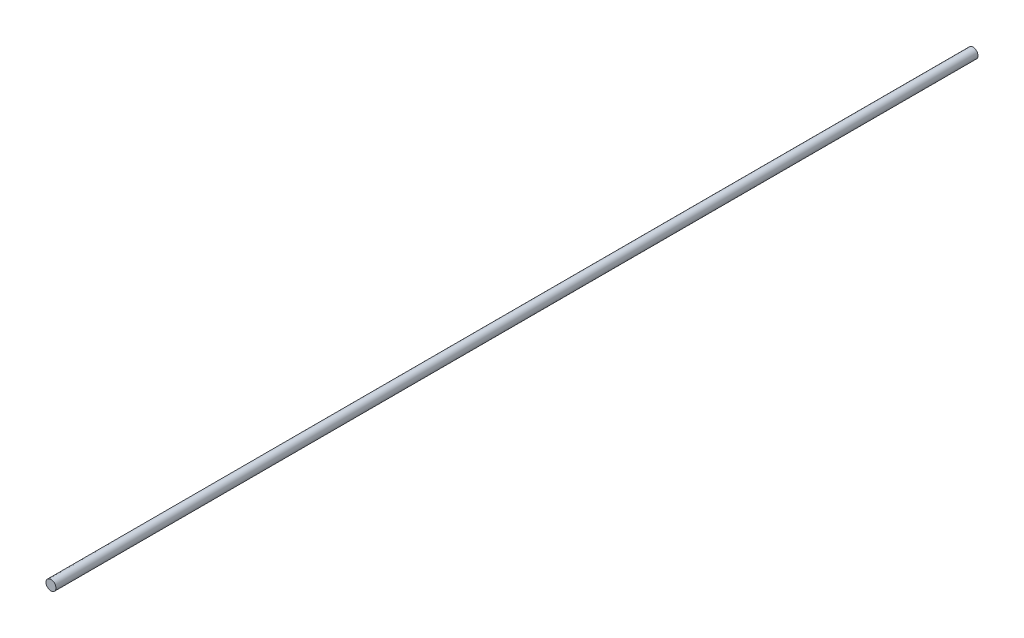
ISO-10303-21;
HEADER;
FILE_DESCRIPTION(('STEP AP214'),'2;1');
FILE_NAME('part.step','',(''),(''),'','','');
FILE_SCHEMA(('AUTOMOTIVE_DESIGN { 1 0 10303 214 1 1 1 1 }'));
ENDSEC;
DATA;
#1=APPLICATION_CONTEXT('core data for automotive mechanical design processes');
#2=APPLICATION_PROTOCOL_DEFINITION('international standard','automotive_design',2000,#1);
#3=PRODUCT_CONTEXT('',#1,'mechanical');
#4=PRODUCT('Part','Part','',(#3));
#5=PRODUCT_RELATED_PRODUCT_CATEGORY('part','',(#4));
#6=PRODUCT_DEFINITION_FORMATION('','',#4);
#7=PRODUCT_DEFINITION_CONTEXT('part definition',#1,'design');
#8=PRODUCT_DEFINITION('design','',#6,#7);
#9=PRODUCT_DEFINITION_SHAPE('','',#8);
#10=(LENGTH_UNIT() NAMED_UNIT(*) SI_UNIT(.MILLI.,.METRE.));
#11=(NAMED_UNIT(*) PLANE_ANGLE_UNIT() SI_UNIT($,.RADIAN.));
#12=(NAMED_UNIT(*) SI_UNIT($,.STERADIAN.) SOLID_ANGLE_UNIT());
#13=UNCERTAINTY_MEASURE_WITH_UNIT(LENGTH_MEASURE(1.E-05),#10,'distance_accuracy_value','');
#14=(GEOMETRIC_REPRESENTATION_CONTEXT(3) GLOBAL_UNCERTAINTY_ASSIGNED_CONTEXT((#13)) GLOBAL_UNIT_ASSIGNED_CONTEXT((#10,
#11,#12)) REPRESENTATION_CONTEXT('',''));
#15=CARTESIAN_POINT('',(0.,0.,0.));
#16=DIRECTION('',(0.,0.,1.));
#17=DIRECTION('',(1.,0.,0.));
#18=AXIS2_PLACEMENT_3D('',#15,#16,#17);
#19=CARTESIAN_POINT('',(0.,0.,250.));
#20=DIRECTION('',(0.,0.,-1.));
#21=DIRECTION('',(-1.,0.,0.));
#22=AXIS2_PLACEMENT_3D('',#19,#20,#21);
#23=CYLINDRICAL_SURFACE('',#22,1.35);
#24=CARTESIAN_POINT('',(0.,0.,250.));
#25=DIRECTION('',(0.,0.,1.));
#26=DIRECTION('',(1.,0.,0.));
#27=AXIS2_PLACEMENT_3D('',#24,#25,#26);
#28=CIRCLE('',#27,1.35);
#29=CARTESIAN_POINT('',(1.35,0.,250.));
#30=VERTEX_POINT('',#29);
#31=EDGE_CURVE('E10',#30,#30,#28,.T.);
#32=ORIENTED_EDGE('',*,*,#31,.F.);
#33=EDGE_LOOP('',(#32));
#34=FACE_BOUND('',#33,.T.);
#35=CARTESIAN_POINT('',(0.,0.,0.));
#36=DIRECTION('',(0.,0.,1.));
#37=DIRECTION('',(1.,0.,0.));
#38=AXIS2_PLACEMENT_3D('',#35,#36,#37);
#39=CIRCLE('',#38,1.35);
#40=CARTESIAN_POINT('',(1.35,0.,0.));
#41=VERTEX_POINT('',#40);
#42=EDGE_CURVE('E34',#41,#41,#39,.T.);
#43=ORIENTED_EDGE('',*,*,#42,.T.);
#44=EDGE_LOOP('',(#43));
#45=FACE_BOUND('',#44,.T.);
#46=ADVANCED_FACE('F28',(#34,#45),#23,.T.);
#47=CARTESIAN_POINT('',(0.,0.,250.));
#48=DIRECTION('',(0.,0.,1.));
#49=DIRECTION('',(1.,0.,0.));
#50=AXIS2_PLACEMENT_3D('',#47,#48,#49);
#51=PLANE('',#50);
#52=ORIENTED_EDGE('',*,*,#31,.T.);
#53=EDGE_LOOP('',(#52));
#54=FACE_BOUND('',#53,.T.);
#55=ADVANCED_FACE('F43',(#54),#51,.T.);
#56=CARTESIAN_POINT('',(0.,0.,0.));
#57=DIRECTION('',(0.,0.,1.));
#58=DIRECTION('',(1.,0.,0.));
#59=AXIS2_PLACEMENT_3D('',#56,#57,#58);
#60=PLANE('',#59);
#61=ORIENTED_EDGE('',*,*,#42,.F.);
#62=EDGE_LOOP('',(#61));
#63=FACE_BOUND('',#62,.T.);
#64=ADVANCED_FACE('F41',(#63),#60,.F.);
#65=CLOSED_SHELL('',(#46,#55,#64));
#66=MANIFOLD_SOLID_BREP('B2',#65);
#67=ADVANCED_BREP_SHAPE_REPRESENTATION('',(#18,#66),#14);
#68=SHAPE_DEFINITION_REPRESENTATION(#9,#67);
ENDSEC;
END-ISO-10303-21;
